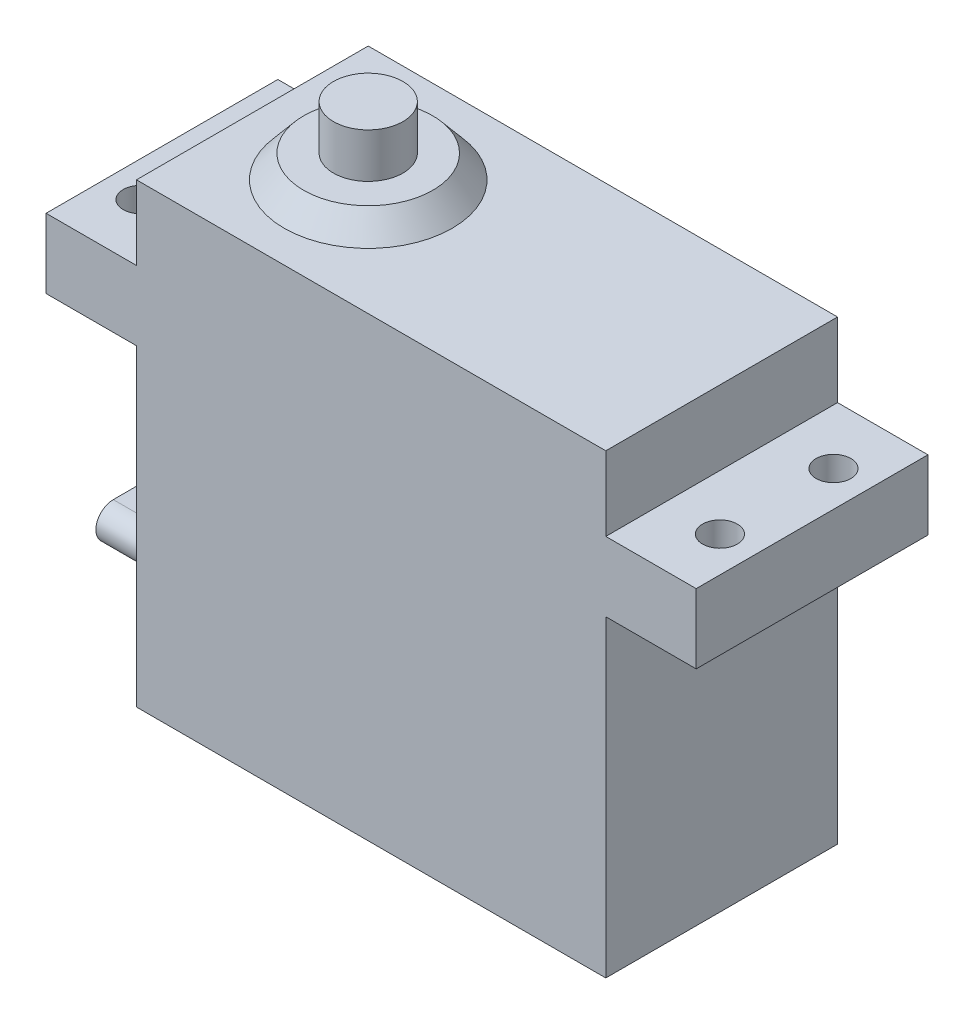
from build123d import *

# Parameters (mm, degrees)
EXTRUSION1_DEPTH        = 20
ESQUISSE2_R             = 1.5
ENL_V_MAT_EXTRU_1_DEPTH = 62.821436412
EXTRUSION5_DEPTH        = 0.5
EXTRUSION6_DEPTH        = 10
ESQUISSE8_R             = 7.25
BOSS_EXTRU_1_DEPTH      = 2
BOSS_EXTRU_1_TAPER      = 40
ESQUISSE9_R             = 3
BOSS_EXTRU_2_DEPTH      = 3.85


with BuildPart() as part:
    # Esquisse1 → Extrusion1 (new body)
    with BuildSketch(Plane.XY):
        Polygon((48.3, 33), (40.5, 33), (40.5, 39.4), (0, 39.4), (0, 33), (-7.8, 33), (-7.8, 27), (0, 27), (0, 0), (40.5, 0), (40.5, 27), (48.3, 27), align=None)
    extrude(amount=EXTRUSION1_DEPTH)

    # Esquisse2 → Enl_v. mat.-Extru.1 (cut, through all)
    with BuildSketch(Plane(origin=(0, 33, 0), x_dir=(1, 0, 0), z_dir=(0, 1, 0))):
        with Locations(Location((-4.75, -5.1, 0), (0, 0, 270))):
            Circle(ESQUISSE2_R)
        with Locations(Location((-4.75, -14.9, 0), (0, 0, 270))):
            Circle(ESQUISSE2_R)
        with Locations(Location((45.25, -14.9, 0), (0, 0, 270))):
            Circle(ESQUISSE2_R)
        with Locations(Location((45.25, -5.1, 0), (0, 0, 270))):
            Circle(ESQUISSE2_R)
    extrude(amount=-ENL_V_MAT_EXTRU_1_DEPTH, mode=Mode.SUBTRACT)

    # Esquisse6 → Extrusion5 (add)
    with BuildSketch(Plane.ZY):
        with BuildLine():
            Line((8.5, 6.5), (11.5, 6.5))
            ThreePointArc((11.5, 6.5), (13.5, 4.5), (11.5, 2.5))
            Line((11.5, 2.5), (8.5, 2.5))
            ThreePointArc((8.5, 2.5), (6.5, 4.5), (8.5, 6.5))
        make_face()
    extrude(amount=EXTRUSION5_DEPTH)

    # Esquisse7 → Extrusion6 (add)
    with BuildSketch(Plane.ZY.offset(0.5)):
        with BuildLine():
            Line((8.5, 3), (11.5, 3))
            ThreePointArc((11.5, 3), (13, 4.5), (11.5, 6))
            Line((11.5, 6), (8.5, 6))
            ThreePointArc((8.5, 6), (7, 4.5), (8.5, 3))
        make_face()
    extrude(amount=EXTRUSION6_DEPTH)

    # Esquisse8 → Boss.-Extru.1 (add)
    with BuildSketch(Plane(origin=(0, 39.4, 0), x_dir=(1, 0, 0), z_dir=(0, 1, 0))):
        with Locations((10, -10)):
            Circle(ESQUISSE8_R)
    extrude(amount=BOSS_EXTRU_1_DEPTH, taper=BOSS_EXTRU_1_TAPER)


with BuildPart() as body_2:
    # Esquisse9 → Boss.-Extru.2 (new body)
    with BuildSketch(Plane(origin=(0, 41.4, 0), x_dir=(1, 0, 0), z_dir=(0, 1, 0))):
        with Locations(Location((10, -10, 0), (0, 0, 90))):
            Circle(ESQUISSE9_R)
    extrude(amount=BOSS_EXTRU_2_DEPTH)


solid = Compound([part.part, body_2.part])
